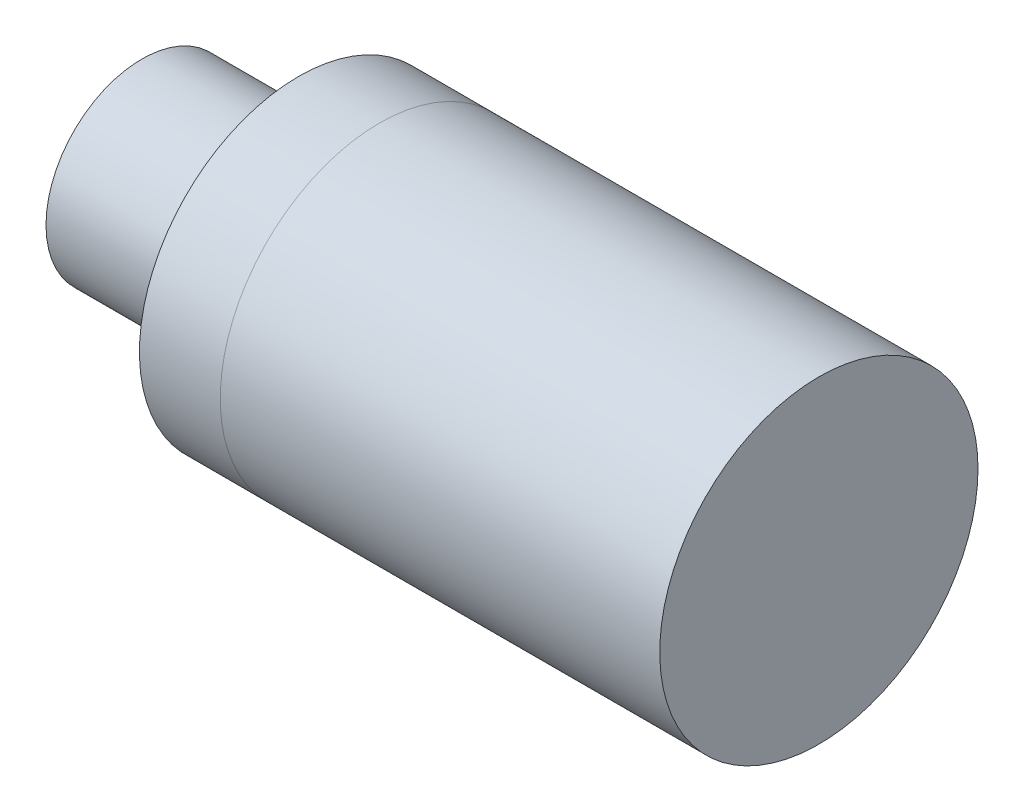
ISO-10303-21;
HEADER;
FILE_DESCRIPTION(('STEP AP214'),'2;1');
FILE_NAME('part.step','',(''),(''),'','','');
FILE_SCHEMA(('AUTOMOTIVE_DESIGN { 1 0 10303 214 1 1 1 1 }'));
ENDSEC;
DATA;
#1=APPLICATION_CONTEXT('core data for automotive mechanical design processes');
#2=APPLICATION_PROTOCOL_DEFINITION('international standard','automotive_design',2000,#1);
#3=PRODUCT_CONTEXT('',#1,'mechanical');
#4=PRODUCT('Part','Part','',(#3));
#5=PRODUCT_RELATED_PRODUCT_CATEGORY('part','',(#4));
#6=PRODUCT_DEFINITION_FORMATION('','',#4);
#7=PRODUCT_DEFINITION_CONTEXT('part definition',#1,'design');
#8=PRODUCT_DEFINITION('design','',#6,#7);
#9=PRODUCT_DEFINITION_SHAPE('','',#8);
#10=(LENGTH_UNIT() NAMED_UNIT(*) SI_UNIT(.MILLI.,.METRE.));
#11=(NAMED_UNIT(*) PLANE_ANGLE_UNIT() SI_UNIT($,.RADIAN.));
#12=(NAMED_UNIT(*) SI_UNIT($,.STERADIAN.) SOLID_ANGLE_UNIT());
#13=UNCERTAINTY_MEASURE_WITH_UNIT(LENGTH_MEASURE(1.E-05),#10,'distance_accuracy_value','');
#14=(GEOMETRIC_REPRESENTATION_CONTEXT(3) GLOBAL_UNCERTAINTY_ASSIGNED_CONTEXT((#13)) GLOBAL_UNIT_ASSIGNED_CONTEXT((#10,
#11,#12)) REPRESENTATION_CONTEXT('',''));
#15=CARTESIAN_POINT('',(0.,0.,0.));
#16=DIRECTION('',(0.,0.,1.));
#17=DIRECTION('',(1.,0.,0.));
#18=AXIS2_PLACEMENT_3D('',#15,#16,#17);
#19=CARTESIAN_POINT('',(17.018,0.,0.));
#20=DIRECTION('',(-1.,0.,0.));
#21=DIRECTION('',(0.,0.,1.));
#22=AXIS2_PLACEMENT_3D('',#19,#20,#21);
#23=CYLINDRICAL_SURFACE('',#22,4.0005);
#24=CARTESIAN_POINT('',(3.937,0.,0.));
#25=DIRECTION('',(1.,0.,0.));
#26=DIRECTION('',(0.,0.,-1.));
#27=AXIS2_PLACEMENT_3D('',#24,#25,#26);
#28=CIRCLE('',#27,4.0005);
#29=CARTESIAN_POINT('',(3.937,0.,-4.0005));
#30=VERTEX_POINT('',#29);
#31=EDGE_CURVE('E49',#30,#30,#28,.T.);
#32=ORIENTED_EDGE('',*,*,#31,.T.);
#33=EDGE_LOOP('',(#32));
#34=FACE_BOUND('',#33,.T.);
#35=CARTESIAN_POINT('',(5.969,0.,0.));
#36=DIRECTION('',(1.,0.,0.));
#37=DIRECTION('',(0.,1.,0.));
#38=AXIS2_PLACEMENT_3D('',#35,#36,#37);
#39=CIRCLE('',#38,4.0005);
#40=CARTESIAN_POINT('',(5.969,4.0005,0.));
#41=VERTEX_POINT('',#40);
#42=EDGE_CURVE('E10',#41,#41,#39,.T.);
#43=ORIENTED_EDGE('',*,*,#42,.F.);
#44=EDGE_LOOP('',(#43));
#45=FACE_BOUND('',#44,.T.);
#46=ADVANCED_FACE('F26',(#34,#45),#23,.T.);
#47=CARTESIAN_POINT('',(3.937,0.,0.));
#48=DIRECTION('',(-1.,0.,0.));
#49=DIRECTION('',(0.,0.,1.));
#50=AXIS2_PLACEMENT_3D('',#47,#48,#49);
#51=CYLINDRICAL_SURFACE('',#50,2.413);
#52=CARTESIAN_POINT('',(3.937,0.,0.));
#53=DIRECTION('',(1.,0.,0.));
#54=DIRECTION('',(0.,0.,-1.));
#55=AXIS2_PLACEMENT_3D('',#52,#53,#54);
#56=CIRCLE('',#55,2.413);
#57=CARTESIAN_POINT('',(3.937,0.,-2.413));
#58=VERTEX_POINT('',#57);
#59=EDGE_CURVE('E34',#58,#58,#56,.T.);
#60=ORIENTED_EDGE('',*,*,#59,.F.);
#61=EDGE_LOOP('',(#60));
#62=FACE_BOUND('',#61,.T.);
#63=CARTESIAN_POINT('',(0.,0.,0.));
#64=DIRECTION('',(1.,0.,0.));
#65=DIRECTION('',(0.,0.,-1.));
#66=AXIS2_PLACEMENT_3D('',#63,#64,#65);
#67=CIRCLE('',#66,2.413);
#68=CARTESIAN_POINT('',(0.,0.,-2.413));
#69=VERTEX_POINT('',#68);
#70=EDGE_CURVE('E40',#69,#69,#67,.T.);
#71=ORIENTED_EDGE('',*,*,#70,.T.);
#72=EDGE_LOOP('',(#71));
#73=FACE_BOUND('',#72,.T.);
#74=ADVANCED_FACE('F28',(#62,#73),#51,.T.);
#75=CARTESIAN_POINT('',(0.,0.,0.));
#76=DIRECTION('',(1.,0.,0.));
#77=DIRECTION('',(0.,0.,-1.));
#78=AXIS2_PLACEMENT_3D('',#75,#76,#77);
#79=PLANE('',#78);
#80=ORIENTED_EDGE('',*,*,#70,.F.);
#81=EDGE_LOOP('',(#80));
#82=FACE_BOUND('',#81,.T.);
#83=ADVANCED_FACE('F58',(#82),#79,.F.);
#84=CARTESIAN_POINT('',(3.937,0.,0.));
#85=DIRECTION('',(1.,0.,0.));
#86=DIRECTION('',(0.,0.,-1.));
#87=AXIS2_PLACEMENT_3D('',#84,#85,#86);
#88=PLANE('',#87);
#89=ORIENTED_EDGE('',*,*,#31,.F.);
#90=EDGE_LOOP('',(#89));
#91=FACE_BOUND('',#90,.T.);
#92=ORIENTED_EDGE('',*,*,#59,.T.);
#93=EDGE_LOOP('',(#92));
#94=FACE_BOUND('',#93,.T.);
#95=ADVANCED_FACE('F55',(#91,#94),#88,.F.);
#96=ORIENTED_EDGE('',*,*,#42,.T.);
#97=EDGE_LOOP('',(#96));
#98=FACE_BOUND('',#97,.T.);
#99=CARTESIAN_POINT('',(17.018,0.,0.));
#100=DIRECTION('',(1.,0.,0.));
#101=DIRECTION('',(0.,0.,-1.));
#102=AXIS2_PLACEMENT_3D('',#99,#100,#101);
#103=CIRCLE('',#102,4.0005);
#104=CARTESIAN_POINT('',(17.018,0.,-4.0005));
#105=VERTEX_POINT('',#104);
#106=EDGE_CURVE('E44',#105,#105,#103,.T.);
#107=ORIENTED_EDGE('',*,*,#106,.F.);
#108=EDGE_LOOP('',(#107));
#109=FACE_BOUND('',#108,.T.);
#110=ADVANCED_FACE('F57',(#98,#109),#23,.T.);
#111=CARTESIAN_POINT('',(17.018,0.,0.));
#112=DIRECTION('',(1.,0.,0.));
#113=DIRECTION('',(0.,0.,-1.));
#114=AXIS2_PLACEMENT_3D('',#111,#112,#113);
#115=PLANE('',#114);
#116=ORIENTED_EDGE('',*,*,#106,.T.);
#117=EDGE_LOOP('',(#116));
#118=FACE_BOUND('',#117,.T.);
#119=ADVANCED_FACE('F65',(#118),#115,.T.);
#120=CLOSED_SHELL('',(#46,#74,#83,#95,#110,#119));
#121=MANIFOLD_SOLID_BREP('B2',#120);
#122=ADVANCED_BREP_SHAPE_REPRESENTATION('',(#18,#121),#14);
#123=SHAPE_DEFINITION_REPRESENTATION(#9,#122);
ENDSEC;
END-ISO-10303-21;
